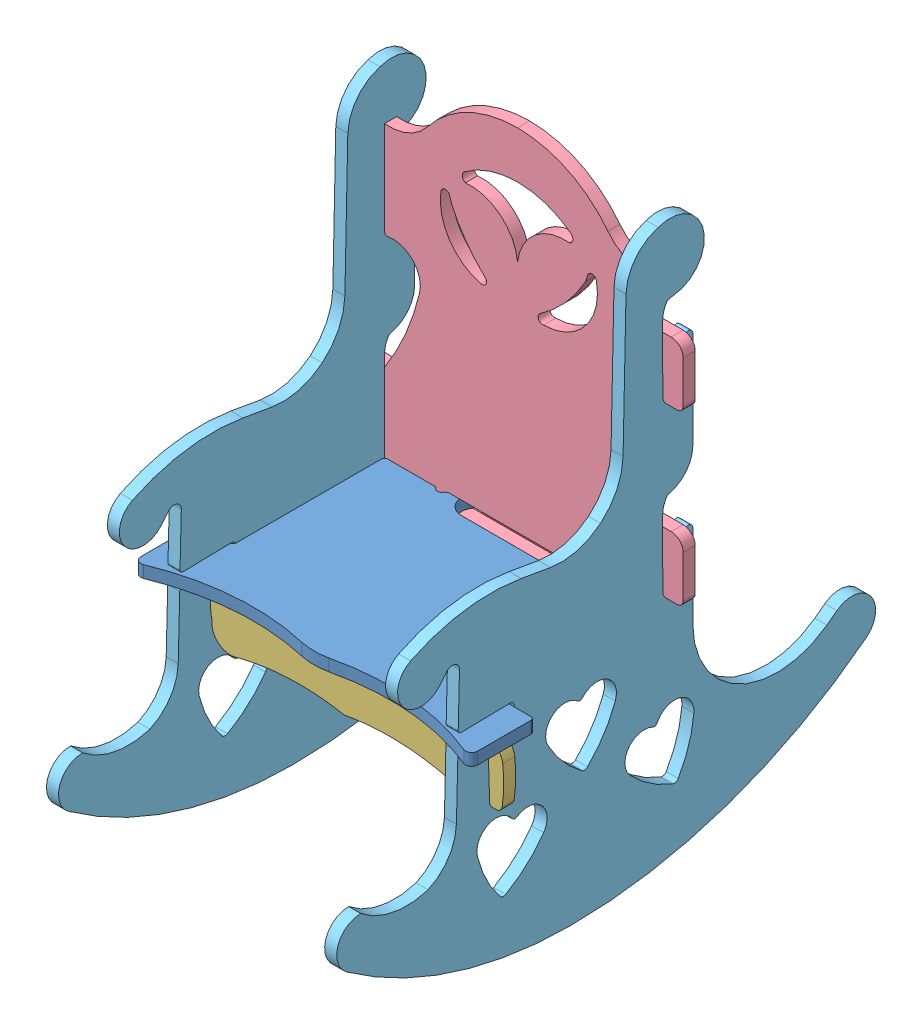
SolidWorks assembly Kids_Rocking_Chair.SLDASM, configuration TempAsmNestConfig (file format 15000). Lengths in mm.
Overall size (355.6 609.19 581.52).
6 component instances, 5 part files, 16 mates.
Components (placement in the parent):
- Rocking Chair - Seat_2-1: Rocking Chair - Seat_2.SLDPRT [Default] at (-86.694 141.7782 98.2855) x (0 0 -1) z (0 1 0)
- Rocking Chair - Seat Wedge_2-1: Rocking Chair - Seat Wedge_2.SLDPRT [Default] at (-59.5001 157.6679 -25.4) x (0 1 0) z (0 0 1)
- Rocking Chair - Seat Brace_2-1: Rocking Chair - Seat Brace_2.SLDPRT [Default] at (-85.0156 119.4033 170.7729) x (1 0 0) z (0 -0.020331 0.999793)
- Rocking Chair - Back_2-1: Rocking Chair - Back_2.SLDPRT [Default] at (-60.0202 332.0093 -12.7)
- Rocking Chair - Sides_2-1: Rocking Chair - Sides_2.SLDPRT [Default] at (105.8706 230.3803 76.8088) x (0 0.999793 0.020331) z (-1 0 0)
- Rocking Chair - Sides_2-2: Rocking Chair - Sides_2.SLDPRT [Default] at (-187.811 230.3803 76.8088) x (0 0.999793 0.020331) z (-1 0 0)
Mates (geometry in assembly coordinates):
- Coincident1: coincident anti-aligned: plane of Rocking Chair - Back_2-1 through (-195.5613 522.8037 0) normal (0 0 -1); plane of assembly through (0 0 0) normal (0 0 1)
- Coincident2: coincident anti-aligned: plane of Rocking Chair - Back_2-1 through (-200.511 210.8188 0) normal (-1 0 0); plane of Rocking Chair - Sides_2-2 through (-200.511 481.5354 4.6446) normal (1 0 0)
- Coincident3: coincident anti-aligned: plane of Rocking Chair - Back_2-1 through (-195.5613 522.8037 12.7) normal (0 0 1); plane of Rocking Chair - Sides_2-2 through (-200.511 261.949 12.7) normal (0 0 -1)
- Coincident4: coincident: point of Rocking Chair - Back_2-1; plane of Rocking Chair - Sides_2-2 through (-200.511 215.594 7.9265) normal (0 1 0)
- Coincident5: coincident anti-aligned: plane of Rocking Chair - Back_2-1 through (80.4706 97.3282 0) normal (1 0 0); plane of Rocking Chair - Sides_2-1 through (80.4706 481.5354 4.6446) normal (-1 0 0)
- Coincident6: coincident anti-aligned: plane of Rocking Chair - Back_2-1 through (-195.5613 522.8037 12.7) normal (0 0 1); plane of Rocking Chair - Sides_2-1 through (93.1706 261.949 12.7) normal (0 0 -1)
- Coincident7: coincident: unknown of Rocking Chair - Back_2-1; plane of Rocking Chair - Sides_2-1 through (93.1706 215.594 7.9265) normal (0 1 0)
- Coincident8: coincident anti-aligned: plane of Rocking Chair - Seat Brace_2-1 through (-208.2739 131.5677 183.7228) normal (0 0.020331 -0.999793); plane of Rocking Chair - Sides_2-1 through (93.1706 121.359 183.5153) normal (0 -0.020331 0.999793)
- Coincident9: coincident anti-aligned: plane of Rocking Chair - Seat Brace_2-1 through (93.1706 111.8106 183.3211) normal (-1 0 0); plane of Rocking Chair - Sides_2-1 through (93.1706 481.5354 4.6446) normal (1 0 0)
- Coincident10: coincident: plane of Rocking Chair - Seat Brace_2-1 through (84.9907 116.5848 183.4182) normal (0 -0.999793 -0.020331); point of Rocking Chair - Sides_2-1
- Coincident11: coincident anti-aligned: plane of Rocking Chair - Seat_2-1 through (11.6668 154.4782 472.8685) normal (0 -1 0); plane of Rocking Chair - Back_2-1 through (-132.6616 154.4782 0) normal (0 1 0)
- Coincident12: coincident anti-aligned: plane of Rocking Chair - Seat_2-1 through (-200.511 154.4782 15.875) normal (-1 0 0); plane of Rocking Chair - Sides_2-2 through (-200.511 481.5354 4.6446) normal (1 0 0)
- Coincident15: coincident: plane of Rocking Chair - Seat_2-1 through (26.0586 154.4782 12.7) normal (-0.000001 0 -1); point of Rocking Chair - Back_2-1
- Coincident17: coincident anti-aligned: plane of Rocking Chair - Seat Wedge_2-1 through (-11.9449 119.5532 0) normal (0 0 1); plane of Rocking Chair - Back_2-1 through (-195.5613 522.8037 0) normal (0 0 -1)
- Distance1: distance = 3 mm anti-aligned: plane of Rocking Chair - Seat Wedge_2-1 through (-110.2303 163.9778 -12.7) normal (-1 0 0); plane of Rocking Chair - Seat_2-1 through (-113.2303 154.4782 -10.9382) normal (1 0 0)
- Coincident19: coincident: point of Rocking Chair - Seat_2-1; plane of Rocking Chair - Seat Wedge_2-1 through (-132.4553 167.1782 -12.7) normal (0 -1 0)
